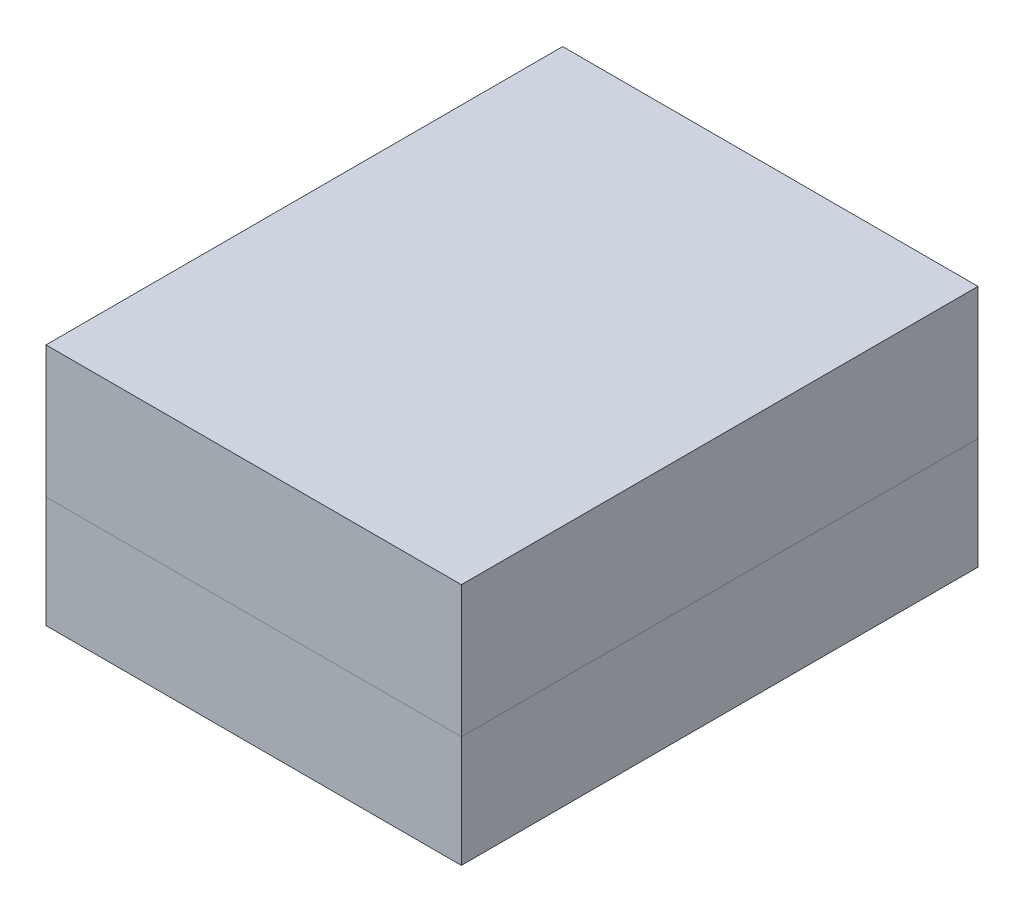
from build123d import *

# Parameters (mm, degrees)
EXTRUDE_6_DEPTH   = 0.06
EXTRUDE_6_2_DEPTH = 0.06
EXTRUDE_6_3_DEPTH = 0.06
SKETCH_3_W        = 1.64
SKETCH_3_H        = 2.04
EXTRUDE_8_DEPTH   = 0.44
SKETCH_8_W        = 1.64
SKETCH_8_H        = 2.04
EXTRUDE_9_DEPTH   = 0.52


with BuildPart() as part:
    # Sketch 1 → Extrude 6 (new body)
    with BuildSketch(Plane(origin=(0, 0, 0), x_dir=(1, 0, 0), z_dir=(0, 1, 0))):
        with BuildLine():
            Line((-70.701403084, 13.804902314), (-69.451403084, 13.804902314))
            ThreePointArc((-69.451403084, 13.804902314), (-69.380692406, 13.775612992), (-69.351403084, 13.704902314))
            Line((-69.351403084, 13.704902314), (-69.351403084, 12.654902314))
            ThreePointArc((-69.351403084, 12.654902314), (-69.380692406, 12.584191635), (-69.451403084, 12.554902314))
            Line((-69.451403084, 12.554902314), (-70.701403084, 12.554902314))
            Line((-70.701403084, 12.554902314), (-70.801403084, 12.654902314))
            Line((-70.801403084, 12.654902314), (-70.801403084, 13.704902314))
            ThreePointArc((-70.801403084, 13.704902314), (-70.772113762, 13.775612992), (-70.701403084, 13.804902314))
        make_face()
    extrude(amount=-EXTRUDE_6_DEPTH)


with BuildPart() as body_2:
    # Sketch 1 → Extrude 6 2 (new body)
    with BuildSketch(Plane(origin=(0, 0, 0), x_dir=(1, 0, 0), z_dir=(0, 1, 0))):
        with BuildLine():
            Line((-70.701403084, 12.304902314), (-70.351403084, 12.304902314))
            ThreePointArc((-70.351403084, 12.304902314), (-70.280692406, 12.275612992), (-70.251403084, 12.204902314))
            Line((-70.251403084, 12.204902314), (-70.251403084, 12.054902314))
            ThreePointArc((-70.251403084, 12.054902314), (-70.280692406, 11.984191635), (-70.351403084, 11.954902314))
            Line((-70.351403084, 11.954902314), (-70.701403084, 11.954902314))
            ThreePointArc((-70.701403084, 11.954902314), (-70.772113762, 11.984191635), (-70.801403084, 12.054902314))
            Line((-70.801403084, 12.054902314), (-70.801403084, 12.204902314))
            ThreePointArc((-70.801403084, 12.204902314), (-70.772113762, 12.275612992), (-70.701403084, 12.304902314))
        make_face()
    extrude(amount=-EXTRUDE_6_2_DEPTH)


with BuildPart() as body_3:
    # Sketch 1 → Extrude 6 3 (new body)
    with BuildSketch(Plane(origin=(0, 0, 0), x_dir=(1, 0, 0), z_dir=(0, 1, 0))):
        with BuildLine():
            Line((-69.801403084, 11.954902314), (-69.451403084, 11.954902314))
            ThreePointArc((-69.451403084, 11.954902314), (-69.380692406, 11.984191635), (-69.351403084, 12.054902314))
            Line((-69.351403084, 12.054902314), (-69.351403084, 12.204902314))
            ThreePointArc((-69.351403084, 12.204902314), (-69.380692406, 12.275612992), (-69.451403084, 12.304902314))
            Line((-69.451403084, 12.304902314), (-69.801403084, 12.304902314))
            ThreePointArc((-69.801403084, 12.304902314), (-69.872113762, 12.275612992), (-69.901403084, 12.204902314))
            Line((-69.901403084, 12.204902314), (-69.901403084, 12.054902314))
            ThreePointArc((-69.901403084, 12.054902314), (-69.872113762, 11.984191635), (-69.801403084, 11.954902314))
        make_face()
    extrude(amount=-EXTRUDE_6_3_DEPTH)


with BuildPart() as body_4:
    # Sketch 3 → Extrude 8 (new body)
    with BuildSketch(Plane(origin=(0, 0, 0), x_dir=(1, 0, 0), z_dir=(0, 1, 0))):
        with Locations((-70.076403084, 12.879902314)):
            Rectangle(SKETCH_3_W, SKETCH_3_H)
    extrude(amount=EXTRUDE_8_DEPTH)


with BuildPart() as body_5:
    # Sketch 8 → Extrude 9 (new body)
    with BuildSketch(Plane(origin=(0, 0.44, 0), x_dir=(-1, 0, 0), z_dir=(0, -1, 0))):
        with Locations((70.076403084, 12.879902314)):
            Rectangle(SKETCH_8_W, SKETCH_8_H)
    extrude(amount=-EXTRUDE_9_DEPTH)


solid = Compound([part.part, body_2.part, body_3.part, body_4.part, body_5.part])
